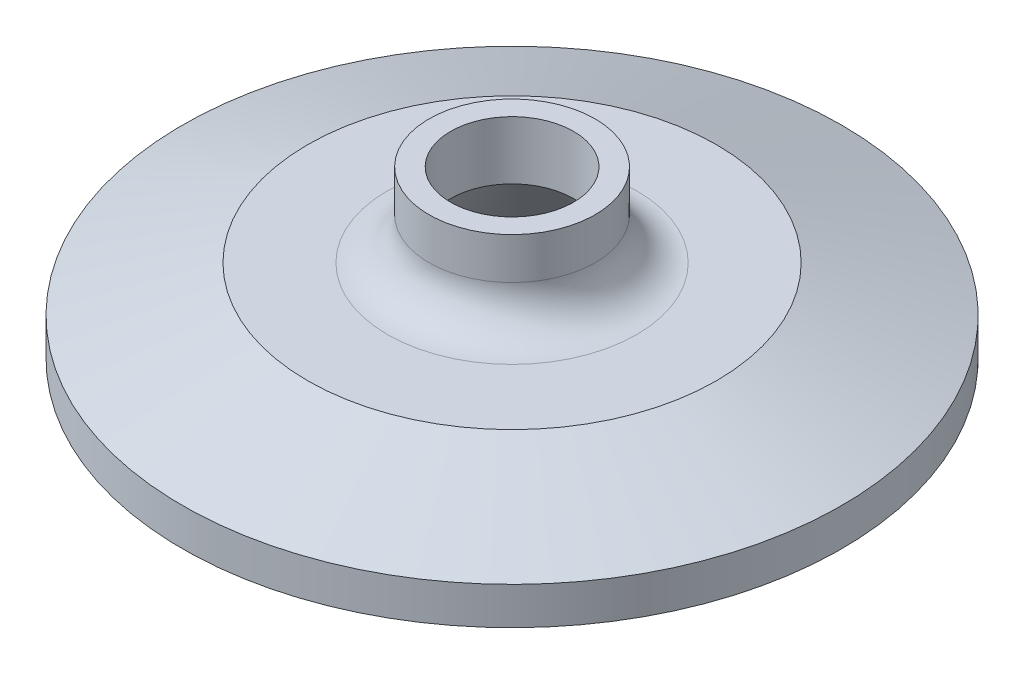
ISO-10303-21;
HEADER;
FILE_DESCRIPTION(('STEP AP214'),'2;1');
FILE_NAME('part.step','',(''),(''),'','','');
FILE_SCHEMA(('AUTOMOTIVE_DESIGN { 1 0 10303 214 1 1 1 1 }'));
ENDSEC;
DATA;
#1=APPLICATION_CONTEXT('core data for automotive mechanical design processes');
#2=APPLICATION_PROTOCOL_DEFINITION('international standard','automotive_design',2000,#1);
#3=PRODUCT_CONTEXT('',#1,'mechanical');
#4=PRODUCT('Part','Part','',(#3));
#5=PRODUCT_RELATED_PRODUCT_CATEGORY('part','',(#4));
#6=PRODUCT_DEFINITION_FORMATION('','',#4);
#7=PRODUCT_DEFINITION_CONTEXT('part definition',#1,'design');
#8=PRODUCT_DEFINITION('design','',#6,#7);
#9=PRODUCT_DEFINITION_SHAPE('','',#8);
#10=(LENGTH_UNIT() NAMED_UNIT(*) SI_UNIT(.MILLI.,.METRE.));
#11=(NAMED_UNIT(*) PLANE_ANGLE_UNIT() SI_UNIT($,.RADIAN.));
#12=(NAMED_UNIT(*) SI_UNIT($,.STERADIAN.) SOLID_ANGLE_UNIT());
#13=UNCERTAINTY_MEASURE_WITH_UNIT(LENGTH_MEASURE(1.E-05),#10,'distance_accuracy_value','');
#14=(GEOMETRIC_REPRESENTATION_CONTEXT(3) GLOBAL_UNCERTAINTY_ASSIGNED_CONTEXT((#13)) GLOBAL_UNIT_ASSIGNED_CONTEXT((#10,
#11,#12)) REPRESENTATION_CONTEXT('',''));
#15=CARTESIAN_POINT('',(0.,0.,0.));
#16=DIRECTION('',(0.,0.,1.));
#17=DIRECTION('',(1.,0.,0.));
#18=AXIS2_PLACEMENT_3D('',#15,#16,#17);
#19=CARTESIAN_POINT('',(-4.699,12.7,0.));
#20=DIRECTION('',(0.,-1.,0.));
#21=DIRECTION('',(0.,0.,-1.));
#22=AXIS2_PLACEMENT_3D('',#19,#20,#21);
#23=PLANE('',#22);
#24=CARTESIAN_POINT('',(0.,12.7,0.));
#25=DIRECTION('',(0.,-1.,0.));
#26=DIRECTION('',(0.,0.,-1.));
#27=AXIS2_PLACEMENT_3D('',#24,#25,#26);
#28=CIRCLE('',#27,6.35);
#29=CARTESIAN_POINT('',(0.,12.7,-6.35));
#30=VERTEX_POINT('',#29);
#31=EDGE_CURVE('E10',#30,#30,#28,.T.);
#32=ORIENTED_EDGE('',*,*,#31,.F.);
#33=EDGE_LOOP('',(#32));
#34=FACE_BOUND('',#33,.T.);
#35=CARTESIAN_POINT('',(0.,12.7,0.));
#36=DIRECTION('',(0.,-1.,0.));
#37=DIRECTION('',(0.,0.,-1.));
#38=AXIS2_PLACEMENT_3D('',#35,#36,#37);
#39=CIRCLE('',#38,4.699);
#40=CARTESIAN_POINT('',(0.,12.7,-4.699));
#41=VERTEX_POINT('',#40);
#42=EDGE_CURVE('E80',#41,#41,#39,.T.);
#43=ORIENTED_EDGE('',*,*,#42,.T.);
#44=EDGE_LOOP('',(#43));
#45=FACE_BOUND('',#44,.T.);
#46=ADVANCED_FACE('F31',(#34,#45),#23,.F.);
#47=CARTESIAN_POINT('',(0.,0.,0.));
#48=DIRECTION('',(0.,-1.,0.));
#49=DIRECTION('',(0.,0.,-1.));
#50=AXIS2_PLACEMENT_3D('',#47,#48,#49);
#51=CYLINDRICAL_SURFACE('',#50,6.35);
#52=CARTESIAN_POINT('',(0.,9.525,0.));
#53=DIRECTION('',(0.,-1.,0.));
#54=DIRECTION('',(0.,0.,-1.));
#55=AXIS2_PLACEMENT_3D('',#52,#53,#54);
#56=CIRCLE('',#55,6.35);
#57=CARTESIAN_POINT('',(0.,9.525,-6.35));
#58=VERTEX_POINT('',#57);
#59=EDGE_CURVE('E37',#58,#58,#56,.T.);
#60=ORIENTED_EDGE('',*,*,#59,.F.);
#61=EDGE_LOOP('',(#60));
#62=FACE_BOUND('',#61,.T.);
#63=ORIENTED_EDGE('',*,*,#31,.T.);
#64=EDGE_LOOP('',(#63));
#65=FACE_BOUND('',#64,.T.);
#66=ADVANCED_FACE('F159',(#62,#65),#51,.T.);
#67=CARTESIAN_POINT('',(0.,9.525,0.));
#68=DIRECTION('',(0.,-1.,0.));
#69=DIRECTION('',(0.,0.,-1.));
#70=AXIS2_PLACEMENT_3D('',#67,#68,#69);
#71=TOROIDAL_SURFACE('',#70,9.525,3.175);
#72=CARTESIAN_POINT('',(0.,6.35,0.));
#73=DIRECTION('',(0.,-1.,0.));
#74=DIRECTION('',(0.,0.,-1.));
#75=AXIS2_PLACEMENT_3D('',#72,#73,#74);
#76=CIRCLE('',#75,9.525);
#77=CARTESIAN_POINT('',(0.,6.35,-9.525));
#78=VERTEX_POINT('',#77);
#79=EDGE_CURVE('E41',#78,#78,#76,.T.);
#80=ORIENTED_EDGE('',*,*,#79,.F.);
#81=EDGE_LOOP('',(#80));
#82=FACE_BOUND('',#81,.T.);
#83=ORIENTED_EDGE('',*,*,#59,.T.);
#84=EDGE_LOOP('',(#83));
#85=FACE_BOUND('',#84,.T.);
#86=ADVANCED_FACE('F154',(#82,#85),#71,.F.);
#87=CARTESIAN_POINT('',(-9.525,6.35,0.));
#88=DIRECTION('',(0.,-1.,0.));
#89=DIRECTION('',(0.,0.,-1.));
#90=AXIS2_PLACEMENT_3D('',#87,#88,#89);
#91=PLANE('',#90);
#92=CARTESIAN_POINT('',(0.,6.35,0.));
#93=DIRECTION('',(0.,-1.,0.));
#94=DIRECTION('',(0.,0.,-1.));
#95=AXIS2_PLACEMENT_3D('',#92,#93,#94);
#96=CIRCLE('',#95,15.6301961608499);
#97=CARTESIAN_POINT('',(0.,6.35,-15.6301961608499));
#98=VERTEX_POINT('',#97);
#99=EDGE_CURVE('E45',#98,#98,#96,.T.);
#100=ORIENTED_EDGE('',*,*,#99,.F.);
#101=EDGE_LOOP('',(#100));
#102=FACE_BOUND('',#101,.T.);
#103=ORIENTED_EDGE('',*,*,#79,.T.);
#104=EDGE_LOOP('',(#103));
#105=FACE_BOUND('',#104,.T.);
#106=ADVANCED_FACE('F148',(#102,#105),#91,.F.);
#107=CARTESIAN_POINT('',(0.,6.35,0.));
#108=DIRECTION('',(0.,-1.,0.));
#109=DIRECTION('',(0.,0.,-1.));
#110=AXIS2_PLACEMENT_3D('',#107,#108,#109);
#111=CONICAL_SURFACE('',#110,15.6301961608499,1.22173047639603);
#112=CARTESIAN_POINT('',(0.,2.86804095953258,0.));
#113=DIRECTION('',(0.,-1.,0.));
#114=DIRECTION('',(0.,0.,-1.));
#115=AXIS2_PLACEMENT_3D('',#112,#113,#114);
#116=CIRCLE('',#115,25.1968);
#117=CARTESIAN_POINT('',(0.,2.86804095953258,-25.1968));
#118=VERTEX_POINT('',#117);
#119=EDGE_CURVE('E50',#118,#118,#116,.T.);
#120=ORIENTED_EDGE('',*,*,#119,.F.);
#121=EDGE_LOOP('',(#120));
#122=FACE_BOUND('',#121,.T.);
#123=ORIENTED_EDGE('',*,*,#99,.T.);
#124=EDGE_LOOP('',(#123));
#125=FACE_BOUND('',#124,.T.);
#126=ADVANCED_FACE('F142',(#122,#125),#111,.T.);
#127=CARTESIAN_POINT('',(0.,0.,0.));
#128=DIRECTION('',(0.,-1.,0.));
#129=DIRECTION('',(0.,0.,-1.));
#130=AXIS2_PLACEMENT_3D('',#127,#128,#129);
#131=CYLINDRICAL_SURFACE('',#130,25.1968);
#132=CARTESIAN_POINT('',(0.,0.,0.));
#133=DIRECTION('',(0.,-1.,0.));
#134=DIRECTION('',(0.,0.,-1.));
#135=AXIS2_PLACEMENT_3D('',#132,#133,#134);
#136=CIRCLE('',#135,25.1968);
#137=CARTESIAN_POINT('',(0.,0.,-25.1968));
#138=VERTEX_POINT('',#137);
#139=EDGE_CURVE('E53',#138,#138,#136,.T.);
#140=ORIENTED_EDGE('',*,*,#139,.F.);
#141=EDGE_LOOP('',(#140));
#142=FACE_BOUND('',#141,.T.);
#143=ORIENTED_EDGE('',*,*,#119,.T.);
#144=EDGE_LOOP('',(#143));
#145=FACE_BOUND('',#144,.T.);
#146=ADVANCED_FACE('F136',(#142,#145),#131,.T.);
#147=CARTESIAN_POINT('',(-25.1968,0.,0.));
#148=DIRECTION('',(0.,1.,0.));
#149=DIRECTION('',(0.,0.,1.));
#150=AXIS2_PLACEMENT_3D('',#147,#148,#149);
#151=PLANE('',#150);
#152=CARTESIAN_POINT('',(0.,0.,0.));
#153=DIRECTION('',(0.,-1.,0.));
#154=DIRECTION('',(0.,0.,-1.));
#155=AXIS2_PLACEMENT_3D('',#152,#153,#154);
#156=CIRCLE('',#155,23.8091722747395);
#157=CARTESIAN_POINT('',(0.,0.,-23.8091722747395));
#158=VERTEX_POINT('',#157);
#159=EDGE_CURVE('E56',#158,#158,#156,.T.);
#160=ORIENTED_EDGE('',*,*,#159,.F.);
#161=EDGE_LOOP('',(#160));
#162=FACE_BOUND('',#161,.T.);
#163=ORIENTED_EDGE('',*,*,#139,.T.);
#164=EDGE_LOOP('',(#163));
#165=FACE_BOUND('',#164,.T.);
#166=ADVANCED_FACE('F130',(#162,#165),#151,.F.);
#167=CARTESIAN_POINT('',(0.,0.7874,0.));
#168=DIRECTION('',(0.,-1.,0.));
#169=DIRECTION('',(0.,0.,-1.));
#170=AXIS2_PLACEMENT_3D('',#167,#168,#169);
#171=TOROIDAL_SURFACE('',#170,23.8091722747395,0.787399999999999);
#172=CARTESIAN_POINT('',(0.,0.479738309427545,0.));
#173=DIRECTION('',(0.,-1.,0.));
#174=DIRECTION('',(0.,0.,-1.));
#175=AXIS2_PLACEMENT_3D('',#172,#173,#174);
#176=CIRCLE('',#175,23.0843667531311);
#177=CARTESIAN_POINT('',(0.,0.479738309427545,-23.0843667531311));
#178=VERTEX_POINT('',#177);
#179=EDGE_CURVE('E59',#178,#178,#176,.T.);
#180=ORIENTED_EDGE('',*,*,#179,.F.);
#181=EDGE_LOOP('',(#180));
#182=FACE_BOUND('',#181,.T.);
#183=ORIENTED_EDGE('',*,*,#159,.T.);
#184=EDGE_LOOP('',(#183));
#185=FACE_BOUND('',#184,.T.);
#186=ADVANCED_FACE('F124',(#182,#185),#171,.T.);
#187=CARTESIAN_POINT('',(0.,0.479738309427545,0.));
#188=DIRECTION('',(0.,-1.,0.));
#189=DIRECTION('',(0.,0.,-1.));
#190=AXIS2_PLACEMENT_3D('',#187,#188,#189);
#191=CONICAL_SURFACE('',#190,23.0843667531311,0.401425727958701);
#192=CARTESIAN_POINT('',(0.,0.872854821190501,0.));
#193=DIRECTION('',(0.,-1.,0.));
#194=DIRECTION('',(0.,0.,-1.));
#195=AXIS2_PLACEMENT_3D('',#192,#193,#194);
#196=CIRCLE('',#195,22.9174986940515);
#197=CARTESIAN_POINT('',(0.,0.872854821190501,-22.9174986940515));
#198=VERTEX_POINT('',#197);
#199=EDGE_CURVE('E62',#198,#198,#196,.T.);
#200=ORIENTED_EDGE('',*,*,#199,.F.);
#201=EDGE_LOOP('',(#200));
#202=FACE_BOUND('',#201,.T.);
#203=ORIENTED_EDGE('',*,*,#179,.T.);
#204=EDGE_LOOP('',(#203));
#205=FACE_BOUND('',#204,.T.);
#206=ADVANCED_FACE('F118',(#202,#205),#191,.F.);
#207=CARTESIAN_POINT('',(0.,0.406400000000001,0.));
#208=DIRECTION('',(0.,-1.,0.));
#209=DIRECTION('',(0.,0.,-1.));
#210=AXIS2_PLACEMENT_3D('',#207,#208,#209);
#211=TOROIDAL_SURFACE('',#210,21.8186,1.1938);
#212=CARTESIAN_POINT('',(0.,0.872854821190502,0.));
#213=DIRECTION('',(0.,-1.,0.));
#214=DIRECTION('',(0.,0.,-1.));
#215=AXIS2_PLACEMENT_3D('',#212,#213,#214);
#216=CIRCLE('',#215,20.7197013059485);
#217=CARTESIAN_POINT('',(0.,0.872854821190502,-20.7197013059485));
#218=VERTEX_POINT('',#217);
#219=EDGE_CURVE('E65',#218,#218,#216,.T.);
#220=ORIENTED_EDGE('',*,*,#219,.F.);
#221=EDGE_LOOP('',(#220));
#222=FACE_BOUND('',#221,.T.);
#223=ORIENTED_EDGE('',*,*,#199,.T.);
#224=EDGE_LOOP('',(#223));
#225=FACE_BOUND('',#224,.T.);
#226=ADVANCED_FACE('F112',(#222,#225),#211,.F.);
#227=CARTESIAN_POINT('',(0.,0.872854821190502,0.));
#228=DIRECTION('',(0.,1.,0.));
#229=DIRECTION('',(0.,0.,1.));
#230=AXIS2_PLACEMENT_3D('',#227,#228,#229);
#231=CONICAL_SURFACE('',#230,20.7197013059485,0.401425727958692);
#232=CARTESIAN_POINT('',(0.,0.479738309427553,0.));
#233=DIRECTION('',(0.,-1.,0.));
#234=DIRECTION('',(0.,0.,-1.));
#235=AXIS2_PLACEMENT_3D('',#232,#233,#234);
#236=CIRCLE('',#235,20.5528332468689);
#237=CARTESIAN_POINT('',(0.,0.479738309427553,-20.5528332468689));
#238=VERTEX_POINT('',#237);
#239=EDGE_CURVE('E68',#238,#238,#236,.T.);
#240=ORIENTED_EDGE('',*,*,#239,.F.);
#241=EDGE_LOOP('',(#240));
#242=FACE_BOUND('',#241,.T.);
#243=ORIENTED_EDGE('',*,*,#219,.T.);
#244=EDGE_LOOP('',(#243));
#245=FACE_BOUND('',#244,.T.);
#246=ADVANCED_FACE('F106',(#242,#245),#231,.T.);
#247=CARTESIAN_POINT('',(0.,0.7874,0.));
#248=DIRECTION('',(0.,-1.,0.));
#249=DIRECTION('',(0.,0.,-1.));
#250=AXIS2_PLACEMENT_3D('',#247,#248,#249);
#251=TOROIDAL_SURFACE('',#250,19.8280277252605,0.787399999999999);
#252=CARTESIAN_POINT('',(0.,0.,0.));
#253=DIRECTION('',(0.,-1.,0.));
#254=DIRECTION('',(0.,0.,-1.));
#255=AXIS2_PLACEMENT_3D('',#252,#253,#254);
#256=CIRCLE('',#255,19.8280277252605);
#257=CARTESIAN_POINT('',(0.,0.,-19.8280277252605));
#258=VERTEX_POINT('',#257);
#259=EDGE_CURVE('E71',#258,#258,#256,.T.);
#260=ORIENTED_EDGE('',*,*,#259,.F.);
#261=EDGE_LOOP('',(#260));
#262=FACE_BOUND('',#261,.T.);
#263=ORIENTED_EDGE('',*,*,#239,.T.);
#264=EDGE_LOOP('',(#263));
#265=FACE_BOUND('',#264,.T.);
#266=ADVANCED_FACE('F100',(#262,#265),#251,.T.);
#267=CARTESIAN_POINT('',(-19.8280277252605,0.,0.));
#268=DIRECTION('',(0.,1.,0.));
#269=DIRECTION('',(0.,0.,1.));
#270=AXIS2_PLACEMENT_3D('',#267,#268,#269);
#271=PLANE('',#270);
#272=CARTESIAN_POINT('',(0.,0.,0.));
#273=DIRECTION('',(0.,-1.,0.));
#274=DIRECTION('',(0.,0.,-1.));
#275=AXIS2_PLACEMENT_3D('',#272,#273,#274);
#276=CIRCLE('',#275,11.049);
#277=CARTESIAN_POINT('',(0.,0.,-11.049));
#278=VERTEX_POINT('',#277);
#279=EDGE_CURVE('E74',#278,#278,#276,.T.);
#280=ORIENTED_EDGE('',*,*,#279,.F.);
#281=EDGE_LOOP('',(#280));
#282=FACE_BOUND('',#281,.T.);
#283=ORIENTED_EDGE('',*,*,#259,.T.);
#284=EDGE_LOOP('',(#283));
#285=FACE_BOUND('',#284,.T.);
#286=ADVANCED_FACE('F94',(#282,#285),#271,.F.);
#287=CARTESIAN_POINT('',(0.,0.,0.));
#288=DIRECTION('',(0.,-1.,0.));
#289=DIRECTION('',(0.,0.,-1.));
#290=AXIS2_PLACEMENT_3D('',#287,#288,#289);
#291=CONICAL_SURFACE('',#290,11.049,0.65606926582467);
#292=CARTESIAN_POINT('',(0.,8.24862077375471,0.));
#293=DIRECTION('',(0.,-1.,0.));
#294=DIRECTION('',(0.,0.,-1.));
#295=AXIS2_PLACEMENT_3D('',#292,#293,#294);
#296=CIRCLE('',#295,4.699);
#297=CARTESIAN_POINT('',(0.,8.24862077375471,-4.699));
#298=VERTEX_POINT('',#297);
#299=EDGE_CURVE('E77',#298,#298,#296,.T.);
#300=ORIENTED_EDGE('',*,*,#299,.F.);
#301=EDGE_LOOP('',(#300));
#302=FACE_BOUND('',#301,.T.);
#303=ORIENTED_EDGE('',*,*,#279,.T.);
#304=EDGE_LOOP('',(#303));
#305=FACE_BOUND('',#304,.T.);
#306=ADVANCED_FACE('F88',(#302,#305),#291,.F.);
#307=CARTESIAN_POINT('',(0.,0.,0.));
#308=DIRECTION('',(0.,-1.,0.));
#309=DIRECTION('',(0.,0.,-1.));
#310=AXIS2_PLACEMENT_3D('',#307,#308,#309);
#311=CYLINDRICAL_SURFACE('',#310,4.699);
#312=ORIENTED_EDGE('',*,*,#42,.F.);
#313=EDGE_LOOP('',(#312));
#314=FACE_BOUND('',#313,.T.);
#315=ORIENTED_EDGE('',*,*,#299,.T.);
#316=EDGE_LOOP('',(#315));
#317=FACE_BOUND('',#316,.T.);
#318=ADVANCED_FACE('F85',(#314,#317),#311,.F.);
#319=CLOSED_SHELL('',(#46,#66,#86,#106,#126,#146,#166,#186,#206,#226,#246,#266,#286,#306,#318));
#320=MANIFOLD_SOLID_BREP('B2',#319);
#321=ADVANCED_BREP_SHAPE_REPRESENTATION('',(#18,#320),#14);
#322=SHAPE_DEFINITION_REPRESENTATION(#9,#321);
ENDSEC;
END-ISO-10303-21;
